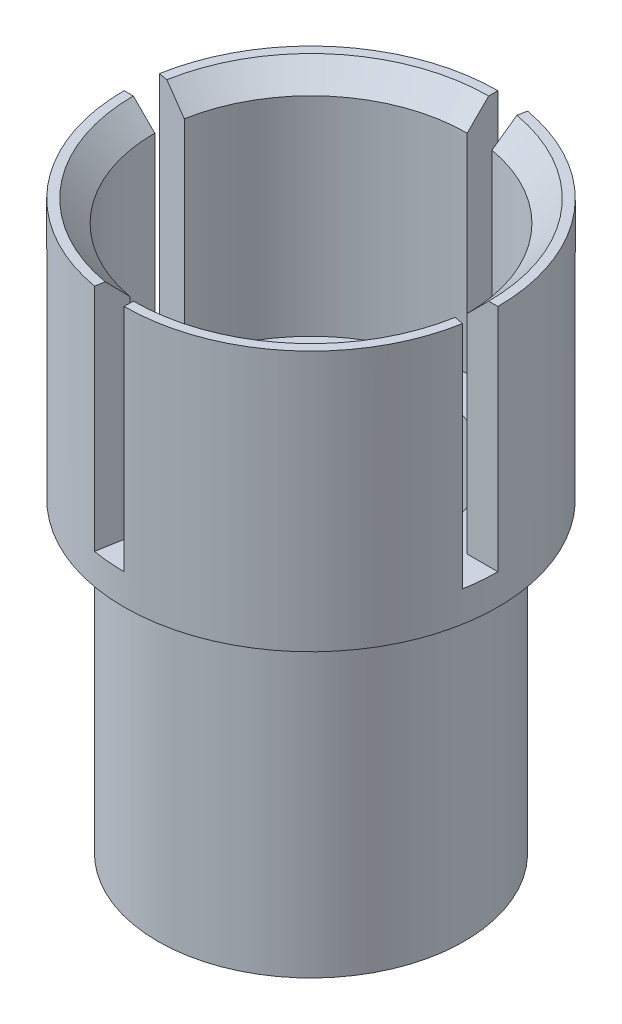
from build123d import *

# Parameters (mm, degrees)
SKETCH1_R           = 12.7
BOSS_EXTRUDE1_DEPTH = 25.4
SKETCH2_R           = 15.494
BOSS_EXTRUDE2_DEPTH = 21.59
SKETCH3_R           = 12.954
CUT_EXTRUDE1_DEPTH  = 19.05
SKETCH4_R           = 10.16
CUT_EXTRUDE2_DEPTH  = 25.4
SKETCH6_R           = 10.16
CUT_EXTRUDE3_DEPTH  = 34.545313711
CHAMFER1_SIZE       = 1.778
SKETCH7_W           = 44.387500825
SKETCH7_H           = 45.009542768
CUT_REVOLVE1_ANGLE  = 10
CIRPATTERN1_COUNT   = 4


with BuildPart() as part:
    # Sketch1 → Boss-Extrude1 (new body)
    with BuildSketch(Plane(origin=(0, 0, 0), x_dir=(1, 0, 0), z_dir=(0, 1, 0))):
        with Locations(Location((0, 0, 0), (0, 0, 270))):
            Circle(SKETCH1_R)
    extrude(amount=BOSS_EXTRUDE1_DEPTH)

    # Sketch2 → Boss-Extrude2 (add)
    with BuildSketch(Plane(origin=(0, 25.4, 0), x_dir=(1, 0, 0), z_dir=(0, 1, 0))):
        with Locations(Location((0, 0, 0), (0, 0, 270))):
            Circle(SKETCH2_R)
    extrude(amount=BOSS_EXTRUDE2_DEPTH)

    # Sketch3 → Cut-Extrude1 (cut)
    with BuildSketch(Plane(origin=(0, 46.99, 0), x_dir=(1, 0, 0), z_dir=(0, 1, 0))):
        with Locations(Location((0, 0, 0), (0, 0, 270))):
            Circle(SKETCH3_R)
    extrude(amount=-CUT_EXTRUDE1_DEPTH, mode=Mode.SUBTRACT)

    # Sketch4 → Cut-Extrude2 (cut)
    with BuildSketch(Plane.XZ):
        with Locations(Location((0, 0, 0), (0, 0, 270))):
            Circle(SKETCH4_R)
    extrude(amount=-CUT_EXTRUDE2_DEPTH, mode=Mode.SUBTRACT)

    # Sketch6 → Cut-Extrude3 (cut, through all)
    with BuildSketch(Plane.XZ.offset(-25.4)):
        with Locations(Location((0, 0, 0), (0, 0, 270))):
            Circle(SKETCH6_R)
    extrude(amount=-CUT_EXTRUDE3_DEPTH, mode=Mode.SUBTRACT)

    # Chamfer1
    chamfer1_edges = [part.edges().sort_by_distance(p)[0] for p in [
        (0, 46.99, -12.954),
    ]]
    chamfer(chamfer1_edges, length=CHAMFER1_SIZE)

    # Sketch7 → Cut-Revolve1 (revolve, cut)
    with BuildSketch(Plane(origin=(0, 0, 0), x_dir=(0, 0, -1), z_dir=(1, 0, 0))):
        with Locations((-35.147750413, 50.444771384)):
            Rectangle(SKETCH7_W, SKETCH7_H)
    cut_revolve1 = revolve(axis=Axis((0, 46.99, 0), (0, -1, 0)), revolution_arc=CUT_REVOLVE1_ANGLE, mode=Mode.SUBTRACT)

    # CirPattern1: Cut-Revolve1 ×4 about axis
    cirpattern1_axis = Axis((0, 25.4, 0), (0, -1, 0))
    for i in range(1, CIRPATTERN1_COUNT):
        add(cut_revolve1.rotate(cirpattern1_axis, i * 360 / CIRPATTERN1_COUNT), mode=Mode.SUBTRACT)


solid = part.part
